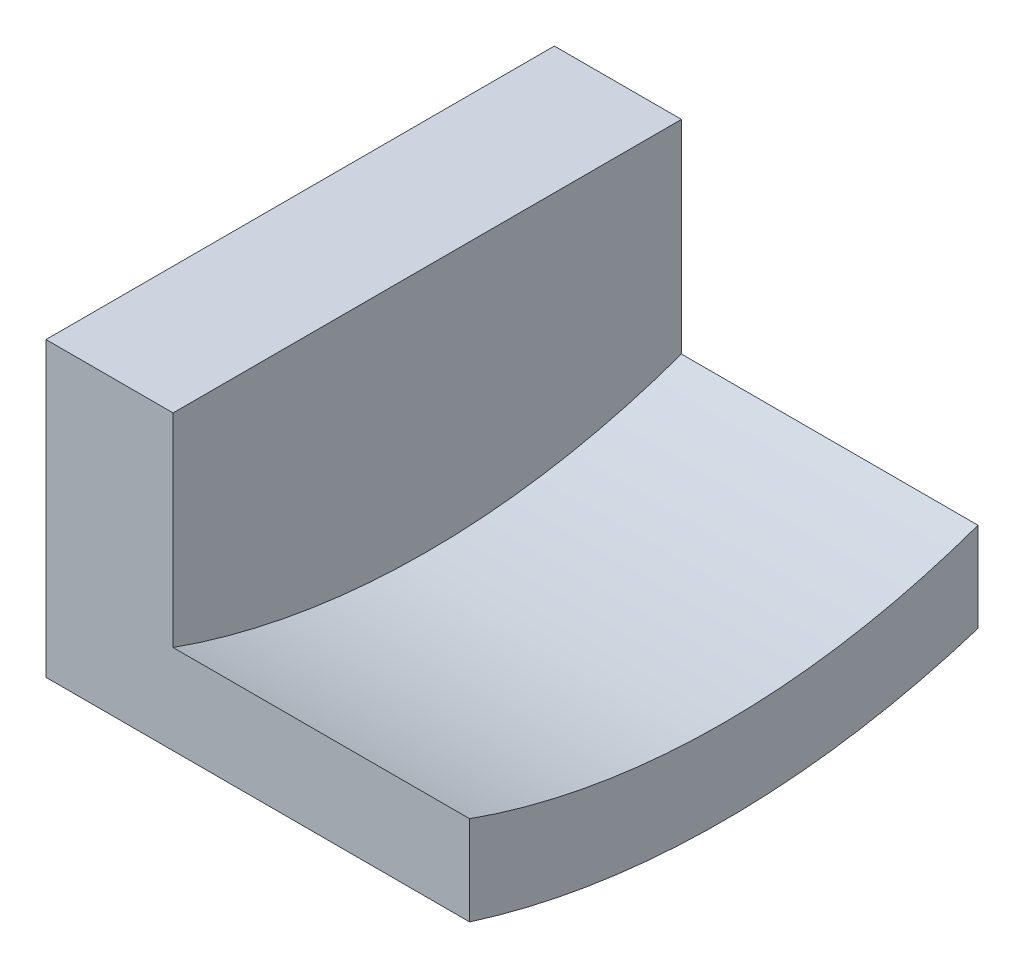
ISO-10303-21;
HEADER;
FILE_DESCRIPTION(('STEP AP214'),'2;1');
FILE_NAME('part.step','',(''),(''),'','','');
FILE_SCHEMA(('AUTOMOTIVE_DESIGN { 1 0 10303 214 1 1 1 1 }'));
ENDSEC;
DATA;
#1=APPLICATION_CONTEXT('core data for automotive mechanical design processes');
#2=APPLICATION_PROTOCOL_DEFINITION('international standard','automotive_design',2000,#1);
#3=PRODUCT_CONTEXT('',#1,'mechanical');
#4=PRODUCT('Part','Part','',(#3));
#5=PRODUCT_RELATED_PRODUCT_CATEGORY('part','',(#4));
#6=PRODUCT_DEFINITION_FORMATION('','',#4);
#7=PRODUCT_DEFINITION_CONTEXT('part definition',#1,'design');
#8=PRODUCT_DEFINITION('design','',#6,#7);
#9=PRODUCT_DEFINITION_SHAPE('','',#8);
#10=(LENGTH_UNIT() NAMED_UNIT(*) SI_UNIT(.MILLI.,.METRE.));
#11=(NAMED_UNIT(*) PLANE_ANGLE_UNIT() SI_UNIT($,.RADIAN.));
#12=(NAMED_UNIT(*) SI_UNIT($,.STERADIAN.) SOLID_ANGLE_UNIT());
#13=UNCERTAINTY_MEASURE_WITH_UNIT(LENGTH_MEASURE(1.E-05),#10,'distance_accuracy_value','');
#14=(GEOMETRIC_REPRESENTATION_CONTEXT(3) GLOBAL_UNCERTAINTY_ASSIGNED_CONTEXT((#13)) GLOBAL_UNIT_ASSIGNED_CONTEXT((#10,
#11,#12)) REPRESENTATION_CONTEXT('',''));
#15=CARTESIAN_POINT('',(0.,0.,0.));
#16=DIRECTION('',(0.,0.,1.));
#17=DIRECTION('',(1.,0.,0.));
#18=AXIS2_PLACEMENT_3D('',#15,#16,#17);
#19=CARTESIAN_POINT('',(0.,-15.8167216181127,0.));
#20=DIRECTION('',(0.,1.,0.));
#21=DIRECTION('',(0.,0.,1.));
#22=AXIS2_PLACEMENT_3D('',#19,#20,#21);
#23=PLANE('',#22);
#24=DIRECTION('',(0.,0.,-1.));
#25=VECTOR('',#24,1.);
#26=CARTESIAN_POINT('',(34.5,-15.8167216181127,23.960019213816));
#27=LINE('',#26,#25);
#28=CARTESIAN_POINT('',(34.5,-15.8167216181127,20.960019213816));
#29=VERTEX_POINT('',#28);
#30=CARTESIAN_POINT('',(34.5,-15.8167216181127,26.960019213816));
#31=VERTEX_POINT('',#30);
#32=EDGE_CURVE('E110',#29,#31,#27,.F.);
#33=ORIENTED_EDGE('',*,*,#32,.F.);
#34=DIRECTION('',(1.,0.,0.));
#35=VECTOR('',#34,1.);
#36=CARTESIAN_POINT('',(0.,-15.8167216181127,20.960019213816));
#37=LINE('',#36,#35);
#38=CARTESIAN_POINT('',(33.,-15.8167216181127,20.960019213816));
#39=VERTEX_POINT('',#38);
#40=EDGE_CURVE('E78',#29,#39,#37,.F.);
#41=ORIENTED_EDGE('',*,*,#40,.T.);
#42=DIRECTION('',(0.,0.,-1.));
#43=VECTOR('',#42,1.);
#44=CARTESIAN_POINT('',(33.,-15.8167216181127,23.960019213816));
#45=LINE('',#44,#43);
#46=CARTESIAN_POINT('',(33.,-15.8167216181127,26.960019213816));
#47=VERTEX_POINT('',#46);
#48=EDGE_CURVE('E82',#39,#47,#45,.F.);
#49=ORIENTED_EDGE('',*,*,#48,.T.);
#50=DIRECTION('',(1.,0.,0.));
#51=VECTOR('',#50,1.);
#52=CARTESIAN_POINT('',(0.,-15.8167216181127,26.960019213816));
#53=LINE('',#52,#51);
#54=EDGE_CURVE('E69',#47,#31,#53,.T.);
#55=ORIENTED_EDGE('',*,*,#54,.T.);
#56=EDGE_LOOP('',(#33,#41,#49,#55));
#57=FACE_BOUND('',#56,.T.);
#58=ADVANCED_FACE('F17',(#57),#23,.T.);
#59=CARTESIAN_POINT('',(34.5,-9.81672161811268,23.960019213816));
#60=DIRECTION('',(1.,0.,0.));
#61=DIRECTION('',(0.,0.,-1.));
#62=AXIS2_PLACEMENT_3D('',#59,#60,#61);
#63=PLANE('',#62);
#64=DIRECTION('',(0.,1.,0.));
#65=VECTOR('',#64,1.);
#66=CARTESIAN_POINT('',(34.5,-15.3167216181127,26.960019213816));
#67=LINE('',#66,#65);
#68=CARTESIAN_POINT('',(34.5,-18.2147928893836,26.960019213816));
#69=VERTEX_POINT('',#68);
#70=EDGE_CURVE('E61',#31,#69,#67,.F.);
#71=ORIENTED_EDGE('',*,*,#70,.T.);
#72=CARTESIAN_POINT('',(34.5,-9.81672161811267,23.960019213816));
#73=DIRECTION('',(-1.,0.,0.));
#74=DIRECTION('',(0.,0.,1.));
#75=AXIS2_PLACEMENT_3D('',#72,#73,#74);
#76=CIRCLE('',#75,8.91782490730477);
#77=CARTESIAN_POINT('',(34.5,-18.2147928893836,20.960019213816));
#78=VERTEX_POINT('',#77);
#79=EDGE_CURVE('E20',#69,#78,#76,.F.);
#80=ORIENTED_EDGE('',*,*,#79,.T.);
#81=DIRECTION('',(0.,-1.,0.));
#82=VECTOR('',#81,1.);
#83=CARTESIAN_POINT('',(34.5,-15.3167216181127,20.960019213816));
#84=LINE('',#83,#82);
#85=EDGE_CURVE('E117',#78,#29,#84,.F.);
#86=ORIENTED_EDGE('',*,*,#85,.T.);
#87=ORIENTED_EDGE('',*,*,#32,.T.);
#88=EDGE_LOOP('',(#71,#80,#86,#87));
#89=FACE_BOUND('',#88,.T.);
#90=ADVANCED_FACE('F192',(#89),#63,.T.);
#91=CARTESIAN_POINT('',(38.,-9.81672161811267,23.960019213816));
#92=DIRECTION('',(-1.,0.,0.));
#93=DIRECTION('',(0.,0.,1.));
#94=AXIS2_PLACEMENT_3D('',#91,#92,#93);
#95=CYLINDRICAL_SURFACE('',#94,8.91782490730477);
#96=DIRECTION('',(1.,0.,0.));
#97=VECTOR('',#96,1.);
#98=CARTESIAN_POINT('',(34.5,-18.2147928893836,26.960019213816));
#99=LINE('',#98,#97);
#100=CARTESIAN_POINT('',(38.,-18.2147928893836,26.960019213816));
#101=VERTEX_POINT('',#100);
#102=EDGE_CURVE('E95',#69,#101,#99,.T.);
#103=ORIENTED_EDGE('',*,*,#102,.T.);
#104=CARTESIAN_POINT('',(38.,-9.81672161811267,23.960019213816));
#105=DIRECTION('',(-1.,0.,0.));
#106=DIRECTION('',(0.,0.,1.));
#107=AXIS2_PLACEMENT_3D('',#104,#105,#106);
#108=CIRCLE('',#107,8.91782490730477);
#109=CARTESIAN_POINT('',(38.,-18.2147928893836,20.960019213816));
#110=VERTEX_POINT('',#109);
#111=EDGE_CURVE('E120',#101,#110,#108,.F.);
#112=ORIENTED_EDGE('',*,*,#111,.T.);
#113=DIRECTION('',(1.,0.,0.));
#114=VECTOR('',#113,1.);
#115=CARTESIAN_POINT('',(34.5,-18.2147928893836,20.960019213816));
#116=LINE('',#115,#114);
#117=EDGE_CURVE('E114',#110,#78,#116,.F.);
#118=ORIENTED_EDGE('',*,*,#117,.T.);
#119=ORIENTED_EDGE('',*,*,#79,.F.);
#120=EDGE_LOOP('',(#103,#112,#118,#119));
#121=FACE_BOUND('',#120,.T.);
#122=ADVANCED_FACE('F141',(#121),#95,.F.);
#123=CARTESIAN_POINT('',(33.,-9.81672161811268,23.960019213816));
#124=DIRECTION('',(1.,0.,0.));
#125=DIRECTION('',(0.,0.,-1.));
#126=AXIS2_PLACEMENT_3D('',#123,#124,#125);
#127=PLANE('',#126);
#128=DIRECTION('',(0.,-1.,0.));
#129=VECTOR('',#128,1.);
#130=CARTESIAN_POINT('',(33.,-15.3167216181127,20.960019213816));
#131=LINE('',#130,#129);
#132=CARTESIAN_POINT('',(33.,-19.2699354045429,20.960019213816));
#133=VERTEX_POINT('',#132);
#134=EDGE_CURVE('E87',#39,#133,#131,.T.);
#135=ORIENTED_EDGE('',*,*,#134,.T.);
#136=CARTESIAN_POINT('',(33.,-9.81672161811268,23.960019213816));
#137=DIRECTION('',(-1.,0.,0.));
#138=DIRECTION('',(0.,0.,1.));
#139=AXIS2_PLACEMENT_3D('',#136,#137,#138);
#140=CIRCLE('',#139,9.91782490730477);
#141=CARTESIAN_POINT('',(33.,-19.2699354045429,26.960019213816));
#142=VERTEX_POINT('',#141);
#143=EDGE_CURVE('E91',#142,#133,#140,.F.);
#144=ORIENTED_EDGE('',*,*,#143,.F.);
#145=DIRECTION('',(0.,1.,0.));
#146=VECTOR('',#145,1.);
#147=CARTESIAN_POINT('',(33.,-15.3167216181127,26.960019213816));
#148=LINE('',#147,#146);
#149=EDGE_CURVE('E76',#142,#47,#148,.T.);
#150=ORIENTED_EDGE('',*,*,#149,.T.);
#151=ORIENTED_EDGE('',*,*,#48,.F.);
#152=EDGE_LOOP('',(#135,#144,#150,#151));
#153=FACE_BOUND('',#152,.T.);
#154=ADVANCED_FACE('F89',(#153),#127,.F.);
#155=CARTESIAN_POINT('',(34.5,-15.3167216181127,20.960019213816));
#156=DIRECTION('',(0.,0.,1.));
#157=DIRECTION('',(0.,-1.,0.));
#158=AXIS2_PLACEMENT_3D('',#155,#156,#157);
#159=PLANE('',#158);
#160=ORIENTED_EDGE('',*,*,#85,.F.);
#161=ORIENTED_EDGE('',*,*,#117,.F.);
#162=DIRECTION('',(0.,1.,0.));
#163=VECTOR('',#162,1.);
#164=CARTESIAN_POINT('',(38.,-9.81672161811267,20.960019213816));
#165=LINE('',#164,#163);
#166=CARTESIAN_POINT('',(38.,-19.2699354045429,20.960019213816));
#167=VERTEX_POINT('',#166);
#168=EDGE_CURVE('E107',#110,#167,#165,.F.);
#169=ORIENTED_EDGE('',*,*,#168,.T.);
#170=DIRECTION('',(-1.,0.,0.));
#171=VECTOR('',#170,1.);
#172=CARTESIAN_POINT('',(34.5,-19.2699354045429,20.960019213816));
#173=LINE('',#172,#171);
#174=EDGE_CURVE('E93',#133,#167,#173,.F.);
#175=ORIENTED_EDGE('',*,*,#174,.F.);
#176=ORIENTED_EDGE('',*,*,#134,.F.);
#177=ORIENTED_EDGE('',*,*,#40,.F.);
#178=EDGE_LOOP('',(#160,#161,#169,#175,#176,#177));
#179=FACE_BOUND('',#178,.T.);
#180=ADVANCED_FACE('F138',(#179),#159,.F.);
#181=CARTESIAN_POINT('',(38.,-9.81672161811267,23.960019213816));
#182=DIRECTION('',(-1.,0.,0.));
#183=DIRECTION('',(0.,0.,1.));
#184=AXIS2_PLACEMENT_3D('',#181,#182,#183);
#185=PLANE('',#184);
#186=ORIENTED_EDGE('',*,*,#168,.F.);
#187=ORIENTED_EDGE('',*,*,#111,.F.);
#188=DIRECTION('',(0.,1.,0.));
#189=VECTOR('',#188,1.);
#190=CARTESIAN_POINT('',(38.,-15.3167216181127,26.960019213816));
#191=LINE('',#190,#189);
#192=CARTESIAN_POINT('',(38.,-19.2699354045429,26.960019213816));
#193=VERTEX_POINT('',#192);
#194=EDGE_CURVE('E35',#101,#193,#191,.F.);
#195=ORIENTED_EDGE('',*,*,#194,.T.);
#196=CARTESIAN_POINT('',(38.,-9.81672161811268,23.960019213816));
#197=DIRECTION('',(-1.,0.,0.));
#198=DIRECTION('',(0.,0.,1.));
#199=AXIS2_PLACEMENT_3D('',#196,#197,#198);
#200=CIRCLE('',#199,9.91782490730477);
#201=EDGE_CURVE('E26',#167,#193,#200,.T.);
#202=ORIENTED_EDGE('',*,*,#201,.F.);
#203=EDGE_LOOP('',(#186,#187,#195,#202));
#204=FACE_BOUND('',#203,.T.);
#205=ADVANCED_FACE('F142',(#204),#185,.F.);
#206=CARTESIAN_POINT('',(34.5,-15.3167216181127,26.960019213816));
#207=DIRECTION('',(0.,0.,-1.));
#208=DIRECTION('',(0.,1.,0.));
#209=AXIS2_PLACEMENT_3D('',#206,#207,#208);
#210=PLANE('',#209);
#211=ORIENTED_EDGE('',*,*,#149,.F.);
#212=DIRECTION('',(-1.,0.,0.));
#213=VECTOR('',#212,1.);
#214=CARTESIAN_POINT('',(34.5,-19.2699354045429,26.960019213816));
#215=LINE('',#214,#213);
#216=EDGE_CURVE('E11',#193,#142,#215,.T.);
#217=ORIENTED_EDGE('',*,*,#216,.F.);
#218=ORIENTED_EDGE('',*,*,#194,.F.);
#219=ORIENTED_EDGE('',*,*,#102,.F.);
#220=ORIENTED_EDGE('',*,*,#70,.F.);
#221=ORIENTED_EDGE('',*,*,#54,.F.);
#222=EDGE_LOOP('',(#211,#217,#218,#219,#220,#221));
#223=FACE_BOUND('',#222,.T.);
#224=ADVANCED_FACE('F74',(#223),#210,.F.);
#225=CARTESIAN_POINT('',(34.5,-9.81672161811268,23.960019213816));
#226=DIRECTION('',(-1.,0.,0.));
#227=DIRECTION('',(0.,0.,1.));
#228=AXIS2_PLACEMENT_3D('',#225,#226,#227);
#229=CYLINDRICAL_SURFACE('',#228,9.91782490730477);
#230=ORIENTED_EDGE('',*,*,#201,.T.);
#231=ORIENTED_EDGE('',*,*,#216,.T.);
#232=ORIENTED_EDGE('',*,*,#143,.T.);
#233=ORIENTED_EDGE('',*,*,#174,.T.);
#234=EDGE_LOOP('',(#230,#231,#232,#233));
#235=FACE_BOUND('',#234,.T.);
#236=ADVANCED_FACE('F140',(#235),#229,.T.);
#237=CLOSED_SHELL('',(#58,#90,#122,#154,#180,#205,#224,#236));
#238=MANIFOLD_SOLID_BREP('B1',#237);
#239=ADVANCED_BREP_SHAPE_REPRESENTATION('',(#18,#238),#14);
#240=SHAPE_DEFINITION_REPRESENTATION(#9,#239);
ENDSEC;
END-ISO-10303-21;
